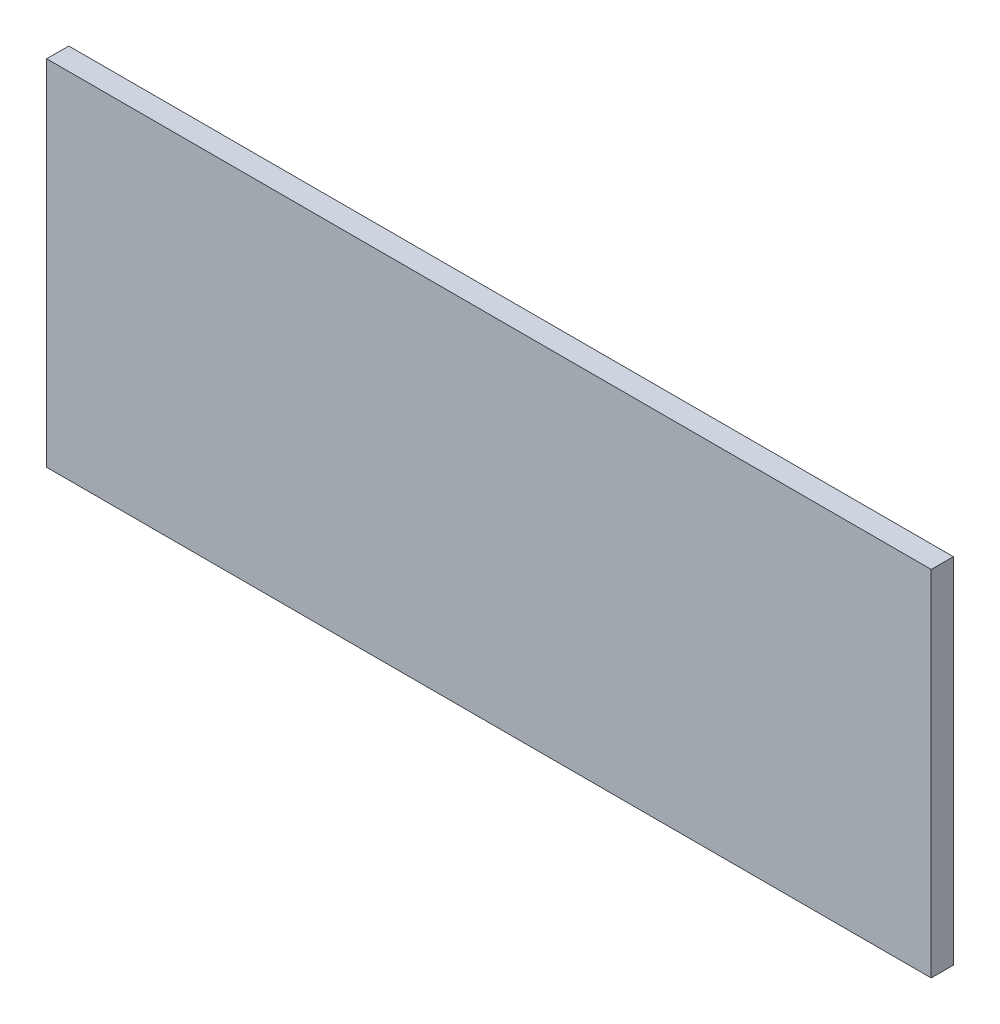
from build123d import *

# Parameters (mm, degrees)
SKETCH1_W           = 200
SKETCH1_H           = 5
BOSS_EXTRUDE1_DEPTH = 80


with BuildPart() as part:
    # Sketch1 → Boss-Extrude1 (new body)
    with BuildSketch(Plane(origin=(0, 0, 0), x_dir=(1, 0, 0), z_dir=(0, 1, 0))):
        Rectangle(SKETCH1_W, SKETCH1_H)
    extrude(amount=BOSS_EXTRUDE1_DEPTH)


solid = part.part
